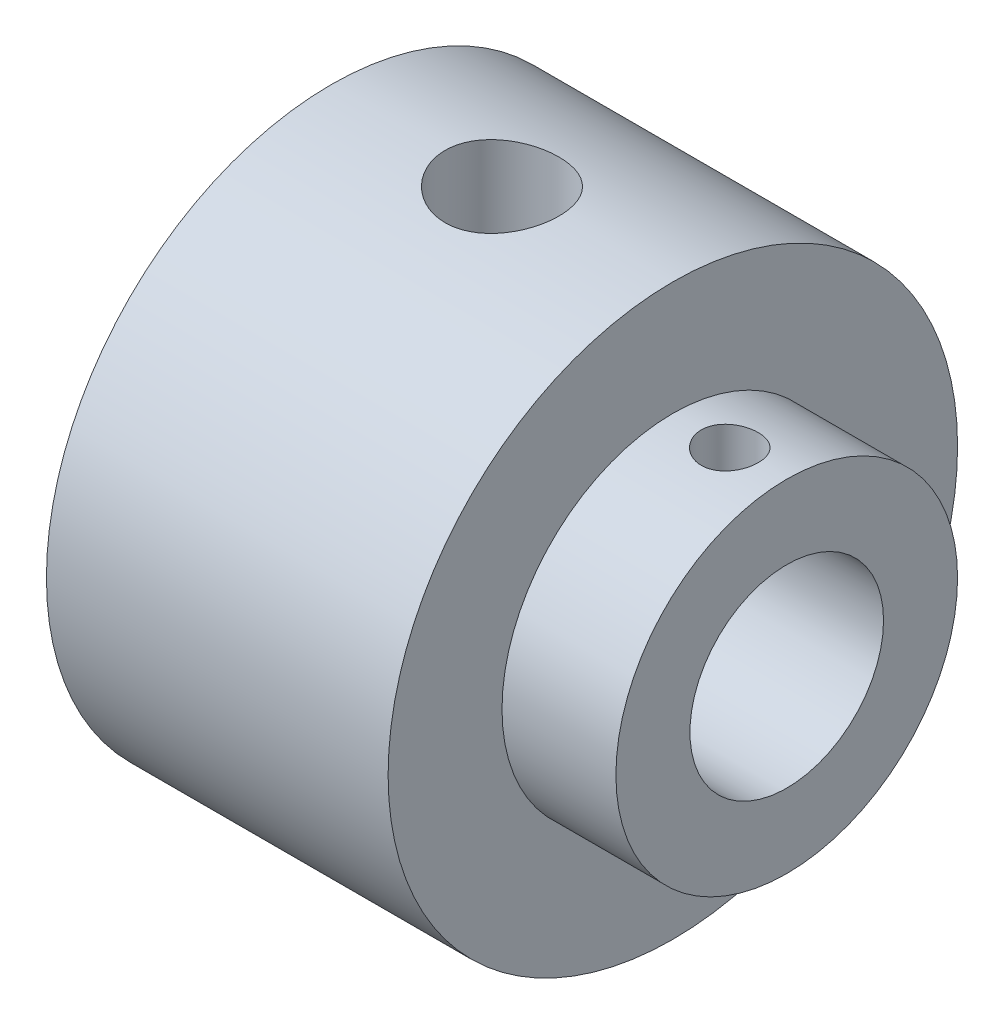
ISO-10303-21;
HEADER;
FILE_DESCRIPTION(('STEP AP214'),'2;1');
FILE_NAME('part.step','',(''),(''),'','','');
FILE_SCHEMA(('AUTOMOTIVE_DESIGN { 1 0 10303 214 1 1 1 1 }'));
ENDSEC;
DATA;
#1=APPLICATION_CONTEXT('core data for automotive mechanical design processes');
#2=APPLICATION_PROTOCOL_DEFINITION('international standard','automotive_design',2000,#1);
#3=PRODUCT_CONTEXT('',#1,'mechanical');
#4=PRODUCT('Part','Part','',(#3));
#5=PRODUCT_RELATED_PRODUCT_CATEGORY('part','',(#4));
#6=PRODUCT_DEFINITION_FORMATION('','',#4);
#7=PRODUCT_DEFINITION_CONTEXT('part definition',#1,'design');
#8=PRODUCT_DEFINITION('design','',#6,#7);
#9=PRODUCT_DEFINITION_SHAPE('','',#8);
#10=(LENGTH_UNIT() NAMED_UNIT(*) SI_UNIT(.MILLI.,.METRE.));
#11=(NAMED_UNIT(*) PLANE_ANGLE_UNIT() SI_UNIT($,.RADIAN.));
#12=(NAMED_UNIT(*) SI_UNIT($,.STERADIAN.) SOLID_ANGLE_UNIT());
#13=UNCERTAINTY_MEASURE_WITH_UNIT(LENGTH_MEASURE(1.E-05),#10,'distance_accuracy_value','');
#14=(GEOMETRIC_REPRESENTATION_CONTEXT(3) GLOBAL_UNCERTAINTY_ASSIGNED_CONTEXT((#13)) GLOBAL_UNIT_ASSIGNED_CONTEXT((#10,
#11,#12)) REPRESENTATION_CONTEXT('',''));
#15=CARTESIAN_POINT('',(0.,0.,0.));
#16=DIRECTION('',(0.,0.,1.));
#17=DIRECTION('',(1.,0.,0.));
#18=AXIS2_PLACEMENT_3D('',#15,#16,#17);
#19=CARTESIAN_POINT('',(0.,0.,0.));
#20=DIRECTION('',(1.,0.,0.));
#21=DIRECTION('',(0.,0.,-1.));
#22=AXIS2_PLACEMENT_3D('',#19,#20,#21);
#23=PLANE('',#22);
#24=CARTESIAN_POINT('',(0.,0.,0.));
#25=DIRECTION('',(1.,0.,0.));
#26=DIRECTION('',(0.,0.,-1.));
#27=AXIS2_PLACEMENT_3D('',#24,#25,#26);
#28=CIRCLE('',#27,8.5);
#29=CARTESIAN_POINT('',(0.,0.,-8.5));
#30=VERTEX_POINT('',#29);
#31=EDGE_CURVE('E53',#30,#30,#28,.T.);
#32=ORIENTED_EDGE('',*,*,#31,.T.);
#33=EDGE_LOOP('',(#32));
#34=FACE_BOUND('',#33,.T.);
#35=CARTESIAN_POINT('',(0.,0.,0.));
#36=DIRECTION('',(-1.,0.,0.));
#37=DIRECTION('',(0.,0.,1.));
#38=AXIS2_PLACEMENT_3D('',#35,#36,#37);
#39=CIRCLE('',#38,25.);
#40=CARTESIAN_POINT('',(0.,0.,25.));
#41=VERTEX_POINT('',#40);
#42=EDGE_CURVE('E10',#41,#41,#39,.T.);
#43=ORIENTED_EDGE('',*,*,#42,.T.);
#44=EDGE_LOOP('',(#43));
#45=FACE_BOUND('',#44,.T.);
#46=ADVANCED_FACE('F30',(#34,#45),#23,.F.);
#47=CARTESIAN_POINT('',(0.,0.,0.));
#48=DIRECTION('',(-1.,0.,0.));
#49=DIRECTION('',(0.,0.,1.));
#50=AXIS2_PLACEMENT_3D('',#47,#48,#49);
#51=CYLINDRICAL_SURFACE('',#50,25.);
#52=CARTESIAN_POINT('',(15.,24.4948974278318,5.));
#53=CARTESIAN_POINT('',(14.8610437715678,24.4948959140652,5.00000277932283));
#54=CARTESIAN_POINT('',(14.722122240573,24.4960820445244,4.99420583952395));
#55=CARTESIAN_POINT('',(14.4452390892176,24.5007881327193,4.97106951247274));
#56=CARTESIAN_POINT('',(14.307277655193,24.5043085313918,4.95372794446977));
#57=CARTESIAN_POINT('',(14.0332858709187,24.5135833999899,4.90762442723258));
#58=CARTESIAN_POINT('',(13.8972565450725,24.5193390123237,4.8788566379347));
#59=CARTESIAN_POINT('',(13.6281110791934,24.5329168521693,4.8101161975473));
#60=CARTESIAN_POINT('',(13.4949960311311,24.5407398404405,4.77013942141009));
#61=CARTESIAN_POINT('',(13.2328438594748,24.5582115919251,4.679356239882));
#62=CARTESIAN_POINT('',(13.1038013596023,24.5678578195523,4.62856486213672));
#63=CARTESIAN_POINT('',(12.8504369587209,24.5887102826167,4.51647818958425));
#64=CARTESIAN_POINT('',(12.7261168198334,24.5999170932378,4.45517901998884));
#65=CARTESIAN_POINT('',(12.4831366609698,24.6235656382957,4.32256259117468));
#66=CARTESIAN_POINT('',(12.3644741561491,24.6360068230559,4.25124978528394));
#67=CARTESIAN_POINT('',(12.1334921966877,24.6617859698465,4.09905714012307));
#68=CARTESIAN_POINT('',(12.0211751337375,24.6751242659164,4.01817372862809));
#69=CARTESIAN_POINT('',(11.8023273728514,24.7024933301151,3.84635941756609));
#70=CARTESIAN_POINT('',(11.6958850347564,24.7165306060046,3.7553169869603));
#71=CARTESIAN_POINT('',(11.4909823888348,24.7447550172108,3.56460271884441));
#72=CARTESIAN_POINT('',(11.3925250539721,24.7589422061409,3.46492769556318));
#73=CARTESIAN_POINT('',(11.2043303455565,24.7870621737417,3.25767968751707));
#74=CARTESIAN_POINT('',(11.114590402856,24.80099502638,3.15010904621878));
#75=CARTESIAN_POINT('',(10.9443844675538,24.8282290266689,2.92772937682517));
#76=CARTESIAN_POINT('',(10.8639219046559,24.8415299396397,2.81291769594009));
#77=CARTESIAN_POINT('',(10.7122400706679,24.867232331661,2.57586269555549));
#78=CARTESIAN_POINT('',(10.6411038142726,24.8796253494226,2.45356521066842));
#79=CARTESIAN_POINT('',(10.5093843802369,24.9030409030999,2.20327286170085));
#80=CARTESIAN_POINT('',(10.4488051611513,24.9140629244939,2.0752758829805));
#81=CARTESIAN_POINT('',(10.2837064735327,24.9445697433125,1.68417147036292));
#82=CARTESIAN_POINT('',(10.1956431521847,24.9615274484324,1.41366454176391));
#83=CARTESIAN_POINT('',(10.0674427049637,24.9865205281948,0.865044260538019));
#84=CARTESIAN_POINT('',(10.0266894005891,24.9946705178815,0.587078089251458));
#85=CARTESIAN_POINT('',(9.99225095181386,25.001544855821,0.028103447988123));
#86=CARTESIAN_POINT('',(9.99856127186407,25.0002701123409,-0.252904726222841));
#87=CARTESIAN_POINT('',(10.0576294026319,24.9885220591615,-0.805712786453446));
#88=CARTESIAN_POINT('',(10.1097244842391,24.9781800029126,-1.07758681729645));
#89=CARTESIAN_POINT('',(10.2578255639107,24.9496087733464,-1.60865738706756));
#90=CARTESIAN_POINT('',(10.3538333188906,24.93137928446,-1.86785341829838));
#91=CARTESIAN_POINT('',(10.5876500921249,24.8888648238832,-2.36809751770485));
#92=CARTESIAN_POINT('',(10.7257187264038,24.8645424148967,-2.60902092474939));
#93=CARTESIAN_POINT('',(11.039545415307,24.812523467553,-3.06452517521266));
#94=CARTESIAN_POINT('',(11.2153078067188,24.7848265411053,-3.27910298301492));
#95=CARTESIAN_POINT('',(11.603168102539,24.7285482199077,-3.67975717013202));
#96=CARTESIAN_POINT('',(11.8158459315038,24.6999598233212,-3.86527158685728));
#97=CARTESIAN_POINT('',(12.269582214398,24.6455785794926,-4.19809246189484));
#98=CARTESIAN_POINT('',(12.5106412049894,24.6197857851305,-4.3453981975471));
#99=CARTESIAN_POINT('',(13.0151041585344,24.5739023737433,-4.5978140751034));
#100=CARTESIAN_POINT('',(13.2785548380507,24.5538240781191,-4.7028332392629));
#101=CARTESIAN_POINT('',(13.8198566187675,24.521823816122,-4.86695170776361));
#102=CARTESIAN_POINT('',(14.0977058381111,24.5099007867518,-4.9260569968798));
#103=CARTESIAN_POINT('',(14.654824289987,24.4957739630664,-4.99583003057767));
#104=CARTESIAN_POINT('',(14.9339878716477,24.493407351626,-5.00730929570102));
#105=CARTESIAN_POINT('',(15.4902411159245,24.4982242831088,-4.98368814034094));
#106=CARTESIAN_POINT('',(15.7673308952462,24.5054072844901,-4.94859036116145));
#107=CARTESIAN_POINT('',(16.308843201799,24.5283616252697,-4.83351104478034));
#108=CARTESIAN_POINT('',(16.5733617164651,24.5440499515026,-4.75396312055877));
#109=CARTESIAN_POINT('',(17.0853163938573,24.5821744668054,-4.55270516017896));
#110=CARTESIAN_POINT('',(17.3327511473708,24.6046112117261,-4.43099165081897));
#111=CARTESIAN_POINT('',(17.8070655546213,24.6540703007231,-4.1470207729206));
#112=CARTESIAN_POINT('',(18.0336352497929,24.6811486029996,-3.98425562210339));
#113=CARTESIAN_POINT('',(18.4565415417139,24.7366861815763,-3.62347762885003));
#114=CARTESIAN_POINT('',(18.6528750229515,24.7651455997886,-3.4254611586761));
#115=CARTESIAN_POINT('',(19.0128128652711,24.8207673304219,-2.99616224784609));
#116=CARTESIAN_POINT('',(19.1758685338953,24.8479030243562,-2.76441580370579));
#117=CARTESIAN_POINT('',(19.4607291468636,24.8973562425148,-2.27633617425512));
#118=CARTESIAN_POINT('',(19.5825358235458,24.9196739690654,-2.02000402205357));
#119=CARTESIAN_POINT('',(19.7806453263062,24.9568652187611,-1.49152568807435));
#120=CARTESIAN_POINT('',(19.8572061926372,24.9717808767,-1.21947909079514));
#121=CARTESIAN_POINT('',(19.9634526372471,24.9926598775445,-0.665901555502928));
#122=CARTESIAN_POINT('',(19.9931438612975,24.9986242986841,-0.384371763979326));
#123=CARTESIAN_POINT('',(20.0018003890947,25.0003623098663,0.0359308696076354));
#124=CARTESIAN_POINT('',(19.9988756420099,24.9997743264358,0.174547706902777));
#125=CARTESIAN_POINT('',(19.9815385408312,24.9963121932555,0.451018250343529));
#126=CARTESIAN_POINT('',(19.9671305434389,24.9934389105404,0.588872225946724));
#127=CARTESIAN_POINT('',(19.9269286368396,24.9854807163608,0.862882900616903));
#128=CARTESIAN_POINT('',(19.9011307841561,24.9803950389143,0.999038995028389));
#129=CARTESIAN_POINT('',(19.8383651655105,24.9681563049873,1.26860706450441));
#130=CARTESIAN_POINT('',(19.8014013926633,24.9610039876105,1.40202000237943));
#131=CARTESIAN_POINT('',(19.716666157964,24.9448434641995,1.66496388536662));
#132=CARTESIAN_POINT('',(19.6689157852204,24.9358388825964,1.79450185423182));
#133=CARTESIAN_POINT('',(19.5629420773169,24.9162142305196,2.04903823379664));
#134=CARTESIAN_POINT('',(19.5047224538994,24.9055947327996,2.17403823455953));
#135=CARTESIAN_POINT('',(19.378193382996,24.8830203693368,2.4187611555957));
#136=CARTESIAN_POINT('',(19.3098797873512,24.8710649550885,2.53848187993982));
#137=CARTESIAN_POINT('',(19.1636856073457,24.8461484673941,2.77176194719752));
#138=CARTESIAN_POINT('',(19.0858083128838,24.8331877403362,2.88532338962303));
#139=CARTESIAN_POINT('',(18.9196372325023,24.8063847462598,3.107409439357));
#140=CARTESIAN_POINT('',(18.8311927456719,24.7925314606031,3.21581998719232));
#141=CARTESIAN_POINT('',(18.6455885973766,24.7645291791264,3.42479299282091));
#142=CARTESIAN_POINT('',(18.5484320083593,24.7503802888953,3.52535819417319));
#143=CARTESIAN_POINT('',(18.345972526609,24.7221657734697,3.71806545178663));
#144=CARTESIAN_POINT('',(18.2406647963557,24.7081002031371,3.81020243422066));
#145=CARTESIAN_POINT('',(18.0227010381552,24.6804587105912,3.98532502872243));
#146=CARTESIAN_POINT('',(17.9100477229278,24.6668826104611,4.06831398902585));
#147=CARTESIAN_POINT('',(17.6768148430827,24.6404498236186,4.22547700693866));
#148=CARTESIAN_POINT('',(17.5561607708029,24.6276028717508,4.29954219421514));
#149=CARTESIAN_POINT('',(17.3089555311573,24.6031736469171,4.43719880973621));
#150=CARTESIAN_POINT('',(17.1824065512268,24.5915909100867,4.50079408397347));
#151=CARTESIAN_POINT('',(16.9243288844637,24.5700331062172,4.61703044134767));
#152=CARTESIAN_POINT('',(16.792803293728,24.5600570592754,4.6696782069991));
#153=CARTESIAN_POINT('',(16.5256860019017,24.5420037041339,4.76364722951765));
#154=CARTESIAN_POINT('',(16.3900950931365,24.5339260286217,4.80497067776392));
#155=CARTESIAN_POINT('',(16.0487823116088,24.516494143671,4.89330917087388));
#156=CARTESIAN_POINT('',(15.841122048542,24.5084401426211,4.93326336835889));
#157=CARTESIAN_POINT('',(15.4222810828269,24.4976430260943,4.98660621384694));
#158=CARTESIAN_POINT('',(15.2111005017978,24.4948997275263,4.99999577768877));
#159=CARTESIAN_POINT('',(15.,24.4948974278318,5.));
#160=B_SPLINE_CURVE_WITH_KNOTS('',3,(#52,#53,#54,#55,#56,#57,#58,#59,#60,#61,#62,#63,#64,#65,
#66,#67,#68,#69,#70,#71,#72,#73,#74,#75,#76,#77,#78,#79,#80,#81,#82,#83,#84,#85,#86,#87,#88,#89,
#90,#91,#92,#93,#94,#95,#96,#97,#98,#99,#100,#101,#102,#103,#104,#105,#106,#107,#108,#109,#110,
#111,#112,#113,#114,#115,#116,#117,#118,#119,#120,#121,#122,#123,#124,#125,#126,#127,#128,#129,
#130,#131,#132,#133,#134,#135,#136,#137,#138,#139,#140,#141,#142,#143,#144,#145,#146,#147,#148,
#149,#150,#151,#152,#153,#154,#155,#156,#157,#158,#159),.UNSPECIFIED.,.T.,.F.,(4,2,2,2,2,2,2,2,
2,2,2,2,2,2,2,2,2,2,2,2,2,2,2,2,2,2,2,2,2,2,2,2,2,2,2,2,2,2,2,2,2,2,2,2,2,2,2,2,2,2,2,2,2,4),
(0.,0.416683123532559,0.833444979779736,1.25042012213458,1.66754891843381,2.08410182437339,
2.50080866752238,2.91733077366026,3.33400883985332,3.75582155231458,4.17779059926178,
4.59963490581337,5.02163466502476,5.44716701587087,5.87285858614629,6.72323197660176,
7.56240100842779,8.40148917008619,9.22862804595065,10.0558000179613,10.8881847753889,
11.7206653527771,12.5676559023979,13.4146624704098,14.2634817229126,15.112190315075,
15.9463764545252,16.780515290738,17.6066556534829,18.4328640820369,19.269841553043,
20.1069052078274,20.9568186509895,21.8066963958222,22.6516792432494,23.4965602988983,
23.9121012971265,24.3274847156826,24.7430120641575,25.158390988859,25.5729647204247,
25.9873917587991,26.4019895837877,26.8164451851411,27.2377409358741,27.6588886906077,
28.0802883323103,28.5015332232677,28.9274855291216,29.3532810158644,29.7788158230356,
30.2042682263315,30.8373096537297,31.4703292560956),.UNSPECIFIED.);
#161=CARTESIAN_POINT('',(15.,24.4948974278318,5.));
#162=VERTEX_POINT('',#161);
#163=EDGE_CURVE('E57',#162,#162,#160,.T.);
#164=ORIENTED_EDGE('',*,*,#163,.T.);
#165=EDGE_LOOP('',(#164));
#166=FACE_BOUND('',#165,.T.);
#167=ORIENTED_EDGE('',*,*,#42,.F.);
#168=EDGE_LOOP('',(#167));
#169=FACE_BOUND('',#168,.T.);
#170=CARTESIAN_POINT('',(30.,0.,0.));
#171=DIRECTION('',(-1.,0.,0.));
#172=DIRECTION('',(0.,0.,1.));
#173=AXIS2_PLACEMENT_3D('',#170,#171,#172);
#174=CIRCLE('',#173,25.);
#175=CARTESIAN_POINT('',(30.,0.,25.));
#176=VERTEX_POINT('',#175);
#177=EDGE_CURVE('E41',#176,#176,#174,.T.);
#178=ORIENTED_EDGE('',*,*,#177,.T.);
#179=EDGE_LOOP('',(#178));
#180=FACE_BOUND('',#179,.T.);
#181=ADVANCED_FACE('F70',(#166,#169,#180),#51,.T.);
#182=CARTESIAN_POINT('',(30.,25.,0.));
#183=DIRECTION('',(-1.,0.,0.));
#184=DIRECTION('',(0.,0.,1.));
#185=AXIS2_PLACEMENT_3D('',#182,#183,#184);
#186=PLANE('',#185);
#187=ORIENTED_EDGE('',*,*,#177,.F.);
#188=EDGE_LOOP('',(#187));
#189=FACE_BOUND('',#188,.T.);
#190=CARTESIAN_POINT('',(30.,0.,0.));
#191=DIRECTION('',(-1.,0.,0.));
#192=DIRECTION('',(0.,0.,1.));
#193=AXIS2_PLACEMENT_3D('',#190,#191,#192);
#194=CIRCLE('',#193,15.);
#195=CARTESIAN_POINT('',(30.,0.,15.));
#196=VERTEX_POINT('',#195);
#197=EDGE_CURVE('E45',#196,#196,#194,.T.);
#198=ORIENTED_EDGE('',*,*,#197,.T.);
#199=EDGE_LOOP('',(#198));
#200=FACE_BOUND('',#199,.T.);
#201=ADVANCED_FACE('F92',(#189,#200),#186,.F.);
#202=CARTESIAN_POINT('',(0.,0.,0.));
#203=DIRECTION('',(-1.,0.,0.));
#204=DIRECTION('',(0.,0.,1.));
#205=AXIS2_PLACEMENT_3D('',#202,#203,#204);
#206=CYLINDRICAL_SURFACE('',#205,15.);
#207=CARTESIAN_POINT('',(35.,14.790199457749,2.49999999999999));
#208=CARTESIAN_POINT('',(34.8606242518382,14.790201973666,2.49999439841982));
#209=CARTESIAN_POINT('',(34.7211723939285,14.7921909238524,2.48830516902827));
#210=CARTESIAN_POINT('',(34.4461814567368,14.7999245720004,2.44187742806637));
#211=CARTESIAN_POINT('',(34.3106461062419,14.8056727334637,2.4071176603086));
#212=CARTESIAN_POINT('',(34.0475077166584,14.8202560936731,2.31562954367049));
#213=CARTESIAN_POINT('',(33.9198981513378,14.8290887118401,2.25891955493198));
#214=CARTESIAN_POINT('',(33.6760190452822,14.8488427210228,2.12518649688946));
#215=CARTESIAN_POINT('',(33.5597482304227,14.8597638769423,2.04816571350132));
#216=CARTESIAN_POINT('',(33.3406871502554,14.8825847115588,1.87518752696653));
#217=CARTESIAN_POINT('',(33.2380248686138,14.8944921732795,1.77906904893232));
#218=CARTESIAN_POINT('',(33.0502066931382,14.9178748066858,1.57097200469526));
#219=CARTESIAN_POINT('',(32.9650518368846,14.9293499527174,1.45899249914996));
#220=CARTESIAN_POINT('',(32.8141854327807,14.9506573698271,1.22152286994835));
#221=CARTESIAN_POINT('',(32.7485929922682,14.9604794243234,1.0959560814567));
#222=CARTESIAN_POINT('',(32.6394789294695,14.9772873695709,0.835395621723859));
#223=CARTESIAN_POINT('',(32.5959558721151,14.9842734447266,0.700402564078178));
#224=CARTESIAN_POINT('',(32.5326074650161,14.994567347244,0.426143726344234));
#225=CARTESIAN_POINT('',(32.5125670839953,14.9979085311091,0.286928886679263));
#226=CARTESIAN_POINT('',(32.4960842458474,15.0006507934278,0.00707528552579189));
#227=CARTESIAN_POINT('',(32.4996401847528,15.0000521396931,-0.133563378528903));
#228=CARTESIAN_POINT('',(32.5300813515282,14.9950085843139,-0.410802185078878));
#229=CARTESIAN_POINT('',(32.5567351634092,14.990601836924,-0.547428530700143));
#230=CARTESIAN_POINT('',(32.6322510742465,14.9784797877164,-0.814241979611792));
#231=CARTESIAN_POINT('',(32.6811138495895,14.9707643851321,-0.944428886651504));
#232=CARTESIAN_POINT('',(32.7998906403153,14.9528269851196,-1.19535614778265));
#233=CARTESIAN_POINT('',(32.8699000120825,14.9425936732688,-1.31605052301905));
#234=CARTESIAN_POINT('',(33.0289128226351,14.920757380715,-1.54406552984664));
#235=CARTESIAN_POINT('',(33.1179177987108,14.9091542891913,-1.65138507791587));
#236=CARTESIAN_POINT('',(33.3136788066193,14.885702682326,-1.85097127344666));
#237=CARTESIAN_POINT('',(33.420637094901,14.8738528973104,-1.9430395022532));
#238=CARTESIAN_POINT('',(33.6485870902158,14.8513795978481,-2.10795458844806));
#239=CARTESIAN_POINT('',(33.7695789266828,14.8407560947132,-2.18080126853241));
#240=CARTESIAN_POINT('',(34.0223916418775,14.8219375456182,-2.30524443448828));
#241=CARTESIAN_POINT('',(34.1542244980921,14.813745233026,-2.35681702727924));
#242=CARTESIAN_POINT('',(34.4248490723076,14.8007618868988,-2.43702987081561));
#243=CARTESIAN_POINT('',(34.5636401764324,14.7959705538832,-2.46567214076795));
#244=CARTESIAN_POINT('',(34.8424661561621,14.7903895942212,-2.49893188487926));
#245=CARTESIAN_POINT('',(34.9824663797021,14.7895528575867,-2.50383220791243));
#246=CARTESIAN_POINT('',(35.2612866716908,14.7918503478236,-2.49022270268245));
#247=CARTESIAN_POINT('',(35.400106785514,14.7949844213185,-2.47171377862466));
#248=CARTESIAN_POINT('',(35.6717277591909,14.8048268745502,-2.41205233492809));
#249=CARTESIAN_POINT('',(35.804561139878,14.8115125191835,-2.37104379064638));
#250=CARTESIAN_POINT('',(36.0614701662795,14.827685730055,-2.26769819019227));
#251=CARTESIAN_POINT('',(36.1855452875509,14.8371734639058,-2.20535985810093));
#252=CARTESIAN_POINT('',(36.4226745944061,14.8579912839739,-2.06045667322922));
#253=CARTESIAN_POINT('',(36.5356165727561,14.8693375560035,-1.97771056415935));
#254=CARTESIAN_POINT('',(36.746113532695,14.8925466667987,-1.79458946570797));
#255=CARTESIAN_POINT('',(36.8436674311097,14.9044095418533,-1.69421323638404));
#256=CARTESIAN_POINT('',(37.0216518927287,14.9274642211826,-1.4774280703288));
#257=CARTESIAN_POINT('',(37.1018938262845,14.9386477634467,-1.36086325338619));
#258=CARTESIAN_POINT('',(37.2416553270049,14.9589511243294,-1.11574344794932));
#259=CARTESIAN_POINT('',(37.3011755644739,14.9680710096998,-0.98718884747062));
#260=CARTESIAN_POINT('',(37.3975105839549,14.9831835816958,-0.722299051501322));
#261=CARTESIAN_POINT('',(37.4344240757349,14.9891898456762,-0.586000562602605));
#262=CARTESIAN_POINT('',(37.4848155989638,14.9974558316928,-0.309030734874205));
#263=CARTESIAN_POINT('',(37.4982955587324,14.9997158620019,-0.168359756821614));
#264=CARTESIAN_POINT('',(37.5013818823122,15.0002303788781,0.111541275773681));
#265=CARTESIAN_POINT('',(37.4912752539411,14.9985330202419,0.250768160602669));
#266=CARTESIAN_POINT('',(37.4480960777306,14.9914217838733,0.525511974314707));
#267=CARTESIAN_POINT('',(37.4150236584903,14.9860079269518,0.661028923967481));
#268=CARTESIAN_POINT('',(37.3269618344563,14.972069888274,0.924396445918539));
#269=CARTESIAN_POINT('',(37.2719968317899,14.9635491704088,1.05225537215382));
#270=CARTESIAN_POINT('',(37.1417420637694,14.9443275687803,1.29698045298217));
#271=CARTESIAN_POINT('',(37.0664513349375,14.9336265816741,1.41384608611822));
#272=CARTESIAN_POINT('',(36.8966649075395,14.9110762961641,1.63471294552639));
#273=CARTESIAN_POINT('',(36.8019590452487,14.8992152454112,1.73855143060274));
#274=CARTESIAN_POINT('',(36.5964716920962,14.8757630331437,1.92896387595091));
#275=CARTESIAN_POINT('',(36.4856864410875,14.8641719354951,2.0155337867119));
#276=CARTESIAN_POINT('',(36.2502546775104,14.8424834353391,2.16951427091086));
#277=CARTESIAN_POINT('',(36.1255156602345,14.8323971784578,2.23678498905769));
#278=CARTESIAN_POINT('',(35.8663907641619,14.8149921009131,2.34931453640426));
#279=CARTESIAN_POINT('',(35.7320146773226,14.8076705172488,2.39459535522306));
#280=CARTESIAN_POINT('',(35.4975962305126,14.7982474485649,2.45202605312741));
#281=CARTESIAN_POINT('',(35.3989731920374,14.7952462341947,2.46998741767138));
#282=CARTESIAN_POINT('',(35.2002465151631,14.7912213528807,2.49397629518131));
#283=CARTESIAN_POINT('',(35.1001429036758,14.7901976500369,2.50000402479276));
#284=CARTESIAN_POINT('',(35.,14.790199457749,2.49999999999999));
#285=B_SPLINE_CURVE_WITH_KNOTS('',3,(#207,#208,#209,#210,#211,#212,#213,#214,#215,#216,#217,
#218,#219,#220,#221,#222,#223,#224,#225,#226,#227,#228,#229,#230,#231,#232,#233,#234,#235,#236,
#237,#238,#239,#240,#241,#242,#243,#244,#245,#246,#247,#248,#249,#250,#251,#252,#253,#254,#255,
#256,#257,#258,#259,#260,#261,#262,#263,#264,#265,#266,#267,#268,#269,#270,#271,#272,#273,#274,
#275,#276,#277,#278,#279,#280,#281,#282,#283,#284),.UNSPECIFIED.,.T.,.F.,(4,2,2,2,2,2,2,2,2,2,2,
2,2,2,2,2,2,2,2,2,2,2,2,2,2,2,2,2,2,2,2,2,2,2,2,2,2,2,4),(0.,0.417761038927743,0.83590751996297,
1.25370499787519,1.67145547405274,2.09289159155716,2.51435267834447,2.93832980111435,
3.36227935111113,3.78231567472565,4.20232344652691,4.61817121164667,5.03403164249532,
5.45179604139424,5.86959426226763,6.29246123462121,6.71533210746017,7.13867662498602,
7.56198385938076,7.98023542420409,8.39847083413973,8.81406064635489,9.22967532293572,
9.649123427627,10.0686010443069,10.4924411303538,10.916267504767,11.3382298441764,
11.7601574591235,12.1769777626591,12.5937957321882,13.0101503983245,13.4265248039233,
13.8476699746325,14.2689137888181,14.6931372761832,15.1169356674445,15.4171067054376,
15.7172722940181),.UNSPECIFIED.);
#286=CARTESIAN_POINT('',(35.,14.790199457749,2.49999999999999));
#287=VERTEX_POINT('',#286);
#288=EDGE_CURVE('E64',#287,#287,#285,.T.);
#289=ORIENTED_EDGE('',*,*,#288,.T.);
#290=EDGE_LOOP('',(#289));
#291=FACE_BOUND('',#290,.T.);
#292=ORIENTED_EDGE('',*,*,#197,.F.);
#293=EDGE_LOOP('',(#292));
#294=FACE_BOUND('',#293,.T.);
#295=CARTESIAN_POINT('',(40.,0.,0.));
#296=DIRECTION('',(-1.,0.,0.));
#297=DIRECTION('',(0.,0.,1.));
#298=AXIS2_PLACEMENT_3D('',#295,#296,#297);
#299=CIRCLE('',#298,15.);
#300=CARTESIAN_POINT('',(40.,0.,15.));
#301=VERTEX_POINT('',#300);
#302=EDGE_CURVE('E50',#301,#301,#299,.T.);
#303=ORIENTED_EDGE('',*,*,#302,.T.);
#304=EDGE_LOOP('',(#303));
#305=FACE_BOUND('',#304,.T.);
#306=ADVANCED_FACE('F88',(#291,#294,#305),#206,.T.);
#307=CARTESIAN_POINT('',(40.,15.,0.));
#308=DIRECTION('',(-1.,0.,0.));
#309=DIRECTION('',(0.,0.,1.));
#310=AXIS2_PLACEMENT_3D('',#307,#308,#309);
#311=PLANE('',#310);
#312=CARTESIAN_POINT('',(40.,0.,0.));
#313=DIRECTION('',(1.,0.,0.));
#314=DIRECTION('',(0.,0.,-1.));
#315=AXIS2_PLACEMENT_3D('',#312,#313,#314);
#316=CIRCLE('',#315,8.5);
#317=CARTESIAN_POINT('',(40.,0.,-8.5));
#318=VERTEX_POINT('',#317);
#319=EDGE_CURVE('E54',#318,#318,#316,.T.);
#320=ORIENTED_EDGE('',*,*,#319,.F.);
#321=EDGE_LOOP('',(#320));
#322=FACE_BOUND('',#321,.T.);
#323=ORIENTED_EDGE('',*,*,#302,.F.);
#324=EDGE_LOOP('',(#323));
#325=FACE_BOUND('',#324,.T.);
#326=ADVANCED_FACE('F85',(#322,#325),#311,.F.);
#327=CARTESIAN_POINT('',(0.,0.,0.));
#328=DIRECTION('',(1.,0.,0.));
#329=DIRECTION('',(0.,0.,-1.));
#330=AXIS2_PLACEMENT_3D('',#327,#328,#329);
#331=CYLINDRICAL_SURFACE('',#330,8.5);
#332=CARTESIAN_POINT('',(35.,8.12403840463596,2.49999999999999));
#333=CARTESIAN_POINT('',(35.1371261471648,8.12404004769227,2.49999796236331));
#334=CARTESIAN_POINT('',(35.2742725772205,8.12754823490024,2.48867946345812));
#335=CARTESIAN_POINT('',(35.5445648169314,8.14114853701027,2.44381537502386));
#336=CARTESIAN_POINT('',(35.677709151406,8.15124304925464,2.41026169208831));
#337=CARTESIAN_POINT('',(35.9360458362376,8.1767759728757,2.32215786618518));
#338=CARTESIAN_POINT('',(36.0612506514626,8.19220574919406,2.26764163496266));
#339=CARTESIAN_POINT('',(36.3007660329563,8.22665909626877,2.13927079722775));
#340=CARTESIAN_POINT('',(36.4150751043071,8.2456831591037,2.06541354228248));
#341=CARTESIAN_POINT('',(36.6330310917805,8.28583044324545,1.89805242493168));
#342=CARTESIAN_POINT('',(36.736297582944,8.30699705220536,1.80406342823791));
#343=CARTESIAN_POINT('',(36.9258534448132,8.34867315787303,1.60014717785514));
#344=CARTESIAN_POINT('',(37.0121407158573,8.36918257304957,1.49021795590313));
#345=CARTESIAN_POINT('',(37.1669285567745,8.40772468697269,1.25484804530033));
#346=CARTESIAN_POINT('',(37.2350430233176,8.42570029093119,1.12914327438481));
#347=CARTESIAN_POINT('',(37.3490198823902,8.45664648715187,0.867445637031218));
#348=CARTESIAN_POINT('',(37.3948868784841,8.46961811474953,0.731454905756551));
#349=CARTESIAN_POINT('',(37.4618129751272,8.48878785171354,0.457024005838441));
#350=CARTESIAN_POINT('',(37.4835210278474,8.49516280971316,0.318754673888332));
#351=CARTESIAN_POINT('',(37.5035631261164,8.50104289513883,0.0403993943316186));
#352=CARTESIAN_POINT('',(37.5019018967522,8.50054941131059,-0.099686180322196));
#353=CARTESIAN_POINT('',(37.475692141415,8.49287406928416,-0.373151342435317));
#354=CARTESIAN_POINT('',(37.4518460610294,8.48589749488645,-0.506604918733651));
#355=CARTESIAN_POINT('',(37.3830886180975,8.46628800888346,-0.767524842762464));
#356=CARTESIAN_POINT('',(37.3381759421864,8.45365474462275,-0.894990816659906));
#357=CARTESIAN_POINT('',(37.228073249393,8.42386378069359,-1.14200961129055));
#358=CARTESIAN_POINT('',(37.1626587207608,8.40665632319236,-1.26145611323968));
#359=CARTESIAN_POINT('',(37.0135857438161,8.3695475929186,-1.48790420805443));
#360=CARTESIAN_POINT('',(36.929923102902,8.34964570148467,-1.5949029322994));
#361=CARTESIAN_POINT('',(36.7430693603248,8.30841132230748,-1.79761108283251));
#362=CARTESIAN_POINT('',(36.6392687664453,8.28705315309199,-1.89275419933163));
#363=CARTESIAN_POINT('',(36.4169744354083,8.24596298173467,-2.06443893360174));
#364=CARTESIAN_POINT('',(36.2984793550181,8.2262311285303,-2.14097884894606));
#365=CARTESIAN_POINT('',(36.048717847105,8.190508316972,-2.27384467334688));
#366=CARTESIAN_POINT('',(35.917347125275,8.17455222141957,-2.32998458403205));
#367=CARTESIAN_POINT('',(35.6464394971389,8.14860398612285,-2.41918075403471));
#368=CARTESIAN_POINT('',(35.5069051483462,8.13860998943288,-2.45224420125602));
#369=CARTESIAN_POINT('',(35.2290040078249,8.126122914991,-2.49330571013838));
#370=CARTESIAN_POINT('',(35.0907753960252,8.12337323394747,-2.50216167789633));
#371=CARTESIAN_POINT('',(34.8148052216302,8.12497791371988,-2.49694674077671));
#372=CARTESIAN_POINT('',(34.6770635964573,8.12933132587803,-2.48287889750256));
#373=CARTESIAN_POINT('',(34.4095042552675,8.14440053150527,-2.43297838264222));
#374=CARTESIAN_POINT('',(34.2795748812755,8.15495668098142,-2.39769132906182));
#375=CARTESIAN_POINT('',(34.0274873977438,8.18107827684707,-2.306983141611));
#376=CARTESIAN_POINT('',(33.9053304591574,8.19664447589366,-2.25155898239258));
#377=CARTESIAN_POINT('',(33.6687477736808,8.23153516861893,-2.12050182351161));
#378=CARTESIAN_POINT('',(33.554605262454,8.25094678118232,-2.04438129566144));
#379=CARTESIAN_POINT('',(33.340400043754,8.29115078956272,-1.87467572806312));
#380=CARTESIAN_POINT('',(33.2403405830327,8.31194350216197,-1.78108667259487));
#381=CARTESIAN_POINT('',(33.0534248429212,8.35347468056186,-1.57507916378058));
#382=CARTESIAN_POINT('',(32.9671750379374,8.37418413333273,-1.46210326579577));
#383=CARTESIAN_POINT('',(32.814847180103,8.4124574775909,-1.22279215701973));
#384=CARTESIAN_POINT('',(32.7487680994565,8.43002152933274,-1.09645762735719));
#385=CARTESIAN_POINT('',(32.639293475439,8.45991559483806,-0.834869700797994));
#386=CARTESIAN_POINT('',(32.5957271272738,8.47228488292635,-0.699692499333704));
#387=CARTESIAN_POINT('',(32.5320639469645,8.49056923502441,-0.423508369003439));
#388=CARTESIAN_POINT('',(32.5119606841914,8.49648606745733,-0.282503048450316));
#389=CARTESIAN_POINT('',(32.4962678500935,8.50109557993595,-0.00428063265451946));
#390=CARTESIAN_POINT('',(32.4997970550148,8.5000479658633,0.132883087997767));
#391=CARTESIAN_POINT('',(32.5291735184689,8.49145383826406,0.404579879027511));
#392=CARTESIAN_POINT('',(32.5550195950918,8.48390766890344,0.539113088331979));
#393=CARTESIAN_POINT('',(32.6277586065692,8.46323443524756,0.800430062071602));
#394=CARTESIAN_POINT('',(32.674439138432,8.45016376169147,0.927277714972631));
#395=CARTESIAN_POINT('',(32.7873325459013,8.41979522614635,1.17140848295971));
#396=CARTESIAN_POINT('',(32.8535485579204,8.40249668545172,1.28869005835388));
#397=CARTESIAN_POINT('',(33.0060215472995,8.36482735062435,1.51431862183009));
#398=CARTESIAN_POINT('',(33.092837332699,8.34437779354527,1.62227473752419));
#399=CARTESIAN_POINT('',(33.2830294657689,8.30297459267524,1.8223817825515));
#400=CARTESIAN_POINT('',(33.3864105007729,8.28202080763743,1.91452822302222));
#401=CARTESIAN_POINT('',(33.6103132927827,8.24128575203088,2.08301441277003));
#402=CARTESIAN_POINT('',(33.731237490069,8.22155447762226,2.15883274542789));
#403=CARTESIAN_POINT('',(33.9846778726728,8.18628031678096,2.28897091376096));
#404=CARTESIAN_POINT('',(34.1171880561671,8.17073527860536,2.34330180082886));
#405=CARTESIAN_POINT('',(34.3738930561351,8.14724808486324,2.42360986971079));
#406=CARTESIAN_POINT('',(34.4972192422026,8.13862442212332,2.45217950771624));
#407=CARTESIAN_POINT('',(34.7470249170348,8.127019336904,2.49037379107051));
#408=CARTESIAN_POINT('',(34.8735038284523,8.12403688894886,2.50000187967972));
#409=CARTESIAN_POINT('',(35.,8.12403840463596,2.49999999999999));
#410=B_SPLINE_CURVE_WITH_KNOTS('',3,(#332,#333,#334,#335,#336,#337,#338,#339,#340,#341,#342,
#343,#344,#345,#346,#347,#348,#349,#350,#351,#352,#353,#354,#355,#356,#357,#358,#359,#360,#361,
#362,#363,#364,#365,#366,#367,#368,#369,#370,#371,#372,#373,#374,#375,#376,#377,#378,#379,#380,
#381,#382,#383,#384,#385,#386,#387,#388,#389,#390,#391,#392,#393,#394,#395,#396,#397,#398,#399,
#400,#401,#402,#403,#404,#405,#406,#407,#408,#409),.UNSPECIFIED.,.T.,.F.,(4,2,2,2,2,2,2,2,2,2,2,
2,2,2,2,2,2,2,2,2,2,2,2,2,2,2,2,2,2,2,2,2,2,2,2,2,2,2,4),(0.,0.410912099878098,
0.821973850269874,1.23237339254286,1.64282916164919,2.06459109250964,2.48640514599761,
2.91657307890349,3.34665196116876,3.76487622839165,4.18301593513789,4.58835076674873,
4.99371087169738,5.40367496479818,5.81373334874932,6.23900922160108,6.66432399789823,
7.09342468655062,7.52239165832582,7.93594602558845,8.34944516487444,8.75274111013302,
9.15609767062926,9.56993137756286,9.98386033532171,10.4127208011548,10.8415594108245,
11.2670947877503,11.6925135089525,12.1021596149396,12.5117840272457,12.9173245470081,
13.3229302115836,13.7411394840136,14.1594673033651,14.5896395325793,15.0195902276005,
15.3987174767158,15.7777758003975),.UNSPECIFIED.);
#411=CARTESIAN_POINT('',(35.,8.12403840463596,2.49999999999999));
#412=VERTEX_POINT('',#411);
#413=EDGE_CURVE('E155',#412,#412,#410,.T.);
#414=ORIENTED_EDGE('',*,*,#413,.T.);
#415=EDGE_LOOP('',(#414));
#416=FACE_BOUND('',#415,.T.);
#417=CARTESIAN_POINT('',(15.,6.87386354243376,5.));
#418=CARTESIAN_POINT('',(15.1263884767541,6.87386328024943,5.00000015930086));
#419=CARTESIAN_POINT('',(15.2527745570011,6.87736235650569,4.99520047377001));
#420=CARTESIAN_POINT('',(15.5044398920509,6.89120233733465,4.97608962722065));
#421=CARTESIAN_POINT('',(15.6297191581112,6.90154317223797,4.96177856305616));
#422=CARTESIAN_POINT('',(15.8782423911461,6.92863932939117,4.92387022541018));
#423=CARTESIAN_POINT('',(16.0014849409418,6.94539893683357,4.90026674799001));
#424=CARTESIAN_POINT('',(16.2450052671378,6.98466632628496,4.84413070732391));
#425=CARTESIAN_POINT('',(16.3652816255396,7.00717680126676,4.8115939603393));
#426=CARTESIAN_POINT('',(16.7187812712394,7.0817754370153,4.70173229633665));
#427=CARTESIAN_POINT('',(16.9466848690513,7.14117199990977,4.61183990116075));
#428=CARTESIAN_POINT('',(17.3839125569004,7.2725046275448,4.40181230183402));
#429=CARTESIAN_POINT('',(17.5932307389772,7.34444465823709,4.2816675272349));
#430=CARTESIAN_POINT('',(18.0143921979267,7.50294471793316,3.9981483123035));
#431=CARTESIAN_POINT('',(18.2236652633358,7.59023048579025,3.83136056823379));
#432=CARTESIAN_POINT('',(18.6134598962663,7.76380092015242,3.46615404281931));
#433=CARTESIAN_POINT('',(18.7939610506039,7.85008483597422,3.26771300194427));
#434=CARTESIAN_POINT('',(19.0486027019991,7.97715958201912,2.93782109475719));
#435=CARTESIAN_POINT('',(19.1341590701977,8.02101011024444,2.81619934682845));
#436=CARTESIAN_POINT('',(19.2945996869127,8.10486891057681,2.56488101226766));
#437=CARTESIAN_POINT('',(19.3694883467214,8.14487876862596,2.4351877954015));
#438=CARTESIAN_POINT('',(19.5077855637,8.21990024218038,2.16850723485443));
#439=CARTESIAN_POINT('',(19.5711989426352,8.25491395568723,2.03152298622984));
#440=CARTESIAN_POINT('',(19.6857611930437,8.31890005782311,1.75115979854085));
#441=CARTESIAN_POINT('',(19.7369119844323,8.34787339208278,1.60778186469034));
#442=CARTESIAN_POINT('',(19.8220424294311,8.39648677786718,1.32932369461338));
#443=CARTESIAN_POINT('',(19.8571725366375,8.41674214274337,1.19470218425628));
#444=CARTESIAN_POINT('',(19.9161879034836,8.45093624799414,0.922235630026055));
#445=CARTESIAN_POINT('',(19.9400747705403,8.46487589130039,0.784391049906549));
#446=CARTESIAN_POINT('',(19.9762200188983,8.48602091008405,0.506770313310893));
#447=CARTESIAN_POINT('',(19.988486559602,8.49323101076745,0.366995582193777));
#448=CARTESIAN_POINT('',(20.0012148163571,8.50071301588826,0.0867294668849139));
#449=CARTESIAN_POINT('',(20.0016776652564,8.50098558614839,-0.053761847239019));
#450=CARTESIAN_POINT('',(19.9914485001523,8.49497185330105,-0.317330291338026));
#451=CARTESIAN_POINT('',(19.9820846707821,8.48946649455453,-0.440479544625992));
#452=CARTESIAN_POINT('',(19.9543279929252,8.47320713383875,-0.685443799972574));
#453=CARTESIAN_POINT('',(19.9359323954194,8.46245153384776,-0.807258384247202));
#454=CARTESIAN_POINT('',(19.8903419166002,8.43594090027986,-1.04863308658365));
#455=CARTESIAN_POINT('',(19.8631500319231,8.42018756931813,-1.16819395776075));
#456=CARTESIAN_POINT('',(19.8002838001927,8.38403670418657,-1.40436247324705));
#457=CARTESIAN_POINT('',(19.7646061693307,8.36363737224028,-1.52096895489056));
#458=CARTESIAN_POINT('',(19.6448417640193,8.29579078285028,-1.86684916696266));
#459=CARTESIAN_POINT('',(19.5483092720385,8.24186605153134,-2.09069284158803));
#460=CARTESIAN_POINT('',(19.3257499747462,8.12116934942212,-2.5191957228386));
#461=CARTESIAN_POINT('',(19.1997150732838,8.05439385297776,-2.72384964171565));
#462=CARTESIAN_POINT('',(18.9050218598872,7.90450835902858,-3.13396607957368));
#463=CARTESIAN_POINT('',(18.7331033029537,7.82040139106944,-3.33672671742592));
#464=CARTESIAN_POINT('',(18.3600390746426,7.64933256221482,-3.71219743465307));
#465=CARTESIAN_POINT('',(18.1588554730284,7.56236711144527,-3.88486786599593));
#466=CARTESIAN_POINT('',(17.7065845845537,7.384303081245,-4.21435506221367));
#467=CARTESIAN_POINT('',(17.4524474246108,7.29378878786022,-4.36738665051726));
#468=CARTESIAN_POINT('',(17.0508018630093,7.17213498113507,-4.56249844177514));
#469=CARTESIAN_POINT('',(16.9135477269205,7.13394390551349,-4.62178663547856));
#470=CARTESIAN_POINT('',(16.6328432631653,7.06383370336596,-4.72824603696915));
#471=CARTESIAN_POINT('',(16.4893952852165,7.03191222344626,-4.77542179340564));
#472=CARTESIAN_POINT('',(16.2324845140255,6.98263217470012,-4.84708756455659));
#473=CARTESIAN_POINT('',(16.120090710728,6.96361723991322,-4.87430483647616));
#474=CARTESIAN_POINT('',(15.8929709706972,6.93071316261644,-4.92097885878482));
#475=CARTESIAN_POINT('',(15.7782455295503,6.91682294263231,-4.94043724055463));
#476=CARTESIAN_POINT('',(15.5472819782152,6.89465862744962,-4.97132228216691));
#477=CARTESIAN_POINT('',(15.431045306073,6.88637954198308,-4.98275607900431));
#478=CARTESIAN_POINT('',(15.1977802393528,6.87572137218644,-4.99745325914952));
#479=CARTESIAN_POINT('',(15.080751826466,6.87334242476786,-5.00071645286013));
#480=CARTESIAN_POINT('',(14.8466891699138,6.87457613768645,-4.99902030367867));
#481=CARTESIAN_POINT('',(14.7296550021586,6.87819377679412,-4.99405412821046));
#482=CARTESIAN_POINT('',(14.4965130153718,6.89129481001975,-4.97596011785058));
#483=CARTESIAN_POINT('',(14.3804055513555,6.90078035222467,-4.96282929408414));
#484=CARTESIAN_POINT('',(14.1499336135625,6.92527848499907,-4.92858602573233));
#485=CARTESIAN_POINT('',(14.0355696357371,6.94029261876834,-4.90747135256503));
#486=CARTESIAN_POINT('',(13.8093014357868,6.97533099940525,-4.85753859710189));
#487=CARTESIAN_POINT('',(13.6973982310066,6.99535727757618,-4.82871739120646));
#488=CARTESIAN_POINT('',(13.365337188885,7.06222982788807,-4.73087760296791));
#489=CARTESIAN_POINT('',(13.1497237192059,7.11576680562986,-4.65061879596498));
#490=CARTESIAN_POINT('',(12.7343673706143,7.23486753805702,-4.46306838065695));
#491=CARTESIAN_POINT('',(12.5346307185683,7.3004359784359,-4.35576623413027));
#492=CARTESIAN_POINT('',(12.1196037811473,7.45002972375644,-4.09552588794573));
#493=CARTESIAN_POINT('',(11.907695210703,7.53527804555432,-3.93788949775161));
#494=CARTESIAN_POINT('',(11.5111491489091,7.70649381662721,-3.5912798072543));
#495=CARTESIAN_POINT('',(11.3265366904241,7.79246185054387,-3.40227807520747));
#496=CARTESIAN_POINT('',(11.0628901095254,7.92111554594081,-3.08561346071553));
#497=CARTESIAN_POINT('',(10.9731897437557,7.96617516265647,-2.96763932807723));
#498=CARTESIAN_POINT('',(10.8041304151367,8.05295289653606,-2.72336552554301));
#499=CARTESIAN_POINT('',(10.7247674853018,8.09467229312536,-2.59706907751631));
#500=CARTESIAN_POINT('',(10.5771588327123,8.17359392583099,-2.33684561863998));
#501=CARTESIAN_POINT('',(10.5089097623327,8.21079752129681,-2.20292092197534));
#502=CARTESIAN_POINT('',(10.3843165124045,8.27960355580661,-1.92826199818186));
#503=CARTESIAN_POINT('',(10.3279706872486,8.31120676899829,-1.78752871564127));
#504=CARTESIAN_POINT('',(10.2318303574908,8.36564383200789,-1.51137716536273));
#505=CARTESIAN_POINT('',(10.1910964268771,8.3889650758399,-1.37638207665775));
#506=CARTESIAN_POINT('',(10.1210307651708,8.42932495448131,-1.10255327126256));
#507=CARTESIAN_POINT('',(10.0916973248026,8.44636453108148,-0.963720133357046));
#508=CARTESIAN_POINT('',(10.0449054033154,8.47364154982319,-0.683518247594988));
#509=CARTESIAN_POINT('',(10.0274374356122,8.48388442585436,-0.542151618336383));
#510=CARTESIAN_POINT('',(10.004635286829,8.49726907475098,-0.258114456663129));
#511=CARTESIAN_POINT('',(9.99929969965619,8.50041167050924,-0.115444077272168));
#512=CARTESIAN_POINT('',(10.0007498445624,8.49955915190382,0.151711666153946));
#513=CARTESIAN_POINT('',(10.0060853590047,8.49641799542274,0.276210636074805));
#514=CARTESIAN_POINT('',(10.0260029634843,8.48472634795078,0.524249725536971));
#515=CARTESIAN_POINT('',(10.0405878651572,8.47617421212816,0.647789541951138));
#516=CARTESIAN_POINT('',(10.0788166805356,8.4538631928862,0.892935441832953));
#517=CARTESIAN_POINT('',(10.1024571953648,8.44010626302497,1.01454223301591));
#518=CARTESIAN_POINT('',(10.1585050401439,8.40770833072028,1.25507082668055));
#519=CARTESIAN_POINT('',(10.190915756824,8.38906544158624,1.37399157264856));
#520=CARTESIAN_POINT('',(10.3001568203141,8.32675827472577,1.72354346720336));
#521=CARTESIAN_POINT('',(10.3893651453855,8.27649334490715,1.94927426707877));
#522=CARTESIAN_POINT('',(10.5975890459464,8.16233248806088,2.3825850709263));
#523=CARTESIAN_POINT('',(10.7166118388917,8.09843326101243,2.59016066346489));
#524=CARTESIAN_POINT('',(10.9957560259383,7.95412679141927,3.00589419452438));
#525=CARTESIAN_POINT('',(11.1589520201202,7.87267785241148,3.21162278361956));
#526=CARTESIAN_POINT('',(11.514590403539,7.70541511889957,3.59447885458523));
#527=CARTESIAN_POINT('',(11.7070667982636,7.61959632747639,3.77157258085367));
#528=CARTESIAN_POINT('',(12.0273343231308,7.48837711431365,4.02300871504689));
#529=CARTESIAN_POINT('',(12.1462638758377,7.44182713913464,4.10824607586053));
#530=CARTESIAN_POINT('',(12.391860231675,7.35114714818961,4.26838282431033));
#531=CARTESIAN_POINT('',(12.5185289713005,7.30701774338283,4.34327960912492));
#532=CARTESIAN_POINT('',(12.7789355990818,7.22273929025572,4.48203401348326));
#533=CARTESIAN_POINT('',(12.9126690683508,7.1825877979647,4.54589842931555));
#534=CARTESIAN_POINT('',(13.186533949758,7.10783616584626,4.66191254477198));
#535=CARTESIAN_POINT('',(13.3266606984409,7.0732320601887,4.71407062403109));
#536=CARTESIAN_POINT('',(13.591433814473,7.01568986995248,4.79920141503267));
#537=CARTESIAN_POINT('',(13.7153263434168,6.99178455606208,4.83386750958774));
#538=CARTESIAN_POINT('',(13.966331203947,6.95004859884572,4.89368553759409));
#539=CARTESIAN_POINT('',(14.093441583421,6.93221436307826,4.91884309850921));
#540=CARTESIAN_POINT('',(14.3498552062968,6.90336747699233,4.95924756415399));
#541=CARTESIAN_POINT('',(14.4791558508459,6.8923472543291,4.97450547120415));
#542=CARTESIAN_POINT('',(14.7389718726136,6.87759552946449,4.99488145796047));
#543=CARTESIAN_POINT('',(14.8694872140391,6.87386381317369,4.99999983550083));
#544=CARTESIAN_POINT('',(15.,6.87386354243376,5.));
#545=B_SPLINE_CURVE_WITH_KNOTS('',3,(#417,#418,#419,#420,#421,#422,#423,#424,#425,#426,#427,
#428,#429,#430,#431,#432,#433,#434,#435,#436,#437,#438,#439,#440,#441,#442,#443,#444,#445,#446,
#447,#448,#449,#450,#451,#452,#453,#454,#455,#456,#457,#458,#459,#460,#461,#462,#463,#464,#465,
#466,#467,#468,#469,#470,#471,#472,#473,#474,#475,#476,#477,#478,#479,#480,#481,#482,#483,#484,
#485,#486,#487,#488,#489,#490,#491,#492,#493,#494,#495,#496,#497,#498,#499,#500,#501,#502,#503,
#504,#505,#506,#507,#508,#509,#510,#511,#512,#513,#514,#515,#516,#517,#518,#519,#520,#521,#522,
#523,#524,#525,#526,#527,#528,#529,#530,#531,#532,#533,#534,#535,#536,#537,#538,#539,#540,#541,
#542,#543,#544),.UNSPECIFIED.,.T.,.F.,(4,2,2,2,2,2,2,2,2,2,2,2,2,2,2,2,2,2,2,2,2,2,2,2,2,2,2,2,
2,2,2,2,2,2,2,2,2,2,2,2,2,2,2,2,2,2,2,2,2,2,2,2,2,2,2,2,2,2,2,2,2,2,2,4),(0.,0.37902313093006,
0.758042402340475,1.13731515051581,1.51676582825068,2.26959953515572,3.02267170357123,
3.86385803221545,4.70563853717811,5.17020411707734,5.63457702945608,6.09875436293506,
6.56285897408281,6.98404701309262,7.40517481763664,7.82600670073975,8.2467981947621,
8.61723697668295,8.98778857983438,9.35821407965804,9.72878316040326,10.4744507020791,
11.2203231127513,12.0533830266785,12.8875324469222,13.8126919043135,14.2750562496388,
14.7372467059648,15.0884778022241,15.439635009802,15.7904795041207,16.1413321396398,
16.4924762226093,16.8437489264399,17.1951197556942,17.5466332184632,18.2523650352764,
18.9583722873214,19.7877574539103,20.6178985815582,21.0820898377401,21.5461024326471,
22.00997500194,22.4737833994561,22.9019345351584,23.3300214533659,23.757765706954,
24.1854603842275,24.5589622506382,24.9325777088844,25.3060530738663,25.6796728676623,
26.4199474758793,27.160401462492,27.9820049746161,28.8045700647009,29.2647382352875,
29.725022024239,30.1850212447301,30.6446901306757,31.0367616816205,31.4286008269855,
31.8200037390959,32.2113951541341),.UNSPECIFIED.);
#546=CARTESIAN_POINT('',(15.,6.87386354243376,5.));
#547=VERTEX_POINT('',#546);
#548=EDGE_CURVE('E33',#547,#547,#545,.T.);
#549=ORIENTED_EDGE('',*,*,#548,.T.);
#550=EDGE_LOOP('',(#549));
#551=FACE_BOUND('',#550,.T.);
#552=ORIENTED_EDGE('',*,*,#31,.F.);
#553=EDGE_LOOP('',(#552));
#554=FACE_BOUND('',#553,.T.);
#555=ORIENTED_EDGE('',*,*,#319,.T.);
#556=EDGE_LOOP('',(#555));
#557=FACE_BOUND('',#556,.T.);
#558=ADVANCED_FACE('F78',(#416,#551,#554,#557),#331,.F.);
#559=CARTESIAN_POINT('',(15.,0.,0.));
#560=DIRECTION('',(0.,1.,0.));
#561=DIRECTION('',(0.,0.,1.));
#562=AXIS2_PLACEMENT_3D('',#559,#560,#561);
#563=CYLINDRICAL_SURFACE('',#562,5.);
#564=ORIENTED_EDGE('',*,*,#548,.F.);
#565=EDGE_LOOP('',(#564));
#566=FACE_BOUND('',#565,.T.);
#567=ORIENTED_EDGE('',*,*,#163,.F.);
#568=EDGE_LOOP('',(#567));
#569=FACE_BOUND('',#568,.T.);
#570=ADVANCED_FACE('F73',(#566,#569),#563,.F.);
#571=CARTESIAN_POINT('',(35.,15.,0.));
#572=DIRECTION('',(0.,1.,0.));
#573=DIRECTION('',(0.,0.,1.));
#574=AXIS2_PLACEMENT_3D('',#571,#572,#573);
#575=CYLINDRICAL_SURFACE('',#574,2.49999999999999);
#576=ORIENTED_EDGE('',*,*,#413,.F.);
#577=EDGE_LOOP('',(#576));
#578=FACE_BOUND('',#577,.T.);
#579=ORIENTED_EDGE('',*,*,#288,.F.);
#580=EDGE_LOOP('',(#579));
#581=FACE_BOUND('',#580,.T.);
#582=ADVANCED_FACE('F77',(#578,#581),#575,.F.);
#583=CLOSED_SHELL('',(#46,#181,#201,#306,#326,#558,#570,#582));
#584=MANIFOLD_SOLID_BREP('B2',#583);
#585=ADVANCED_BREP_SHAPE_REPRESENTATION('',(#18,#584),#14);
#586=SHAPE_DEFINITION_REPRESENTATION(#9,#585);
ENDSEC;
END-ISO-10303-21;
